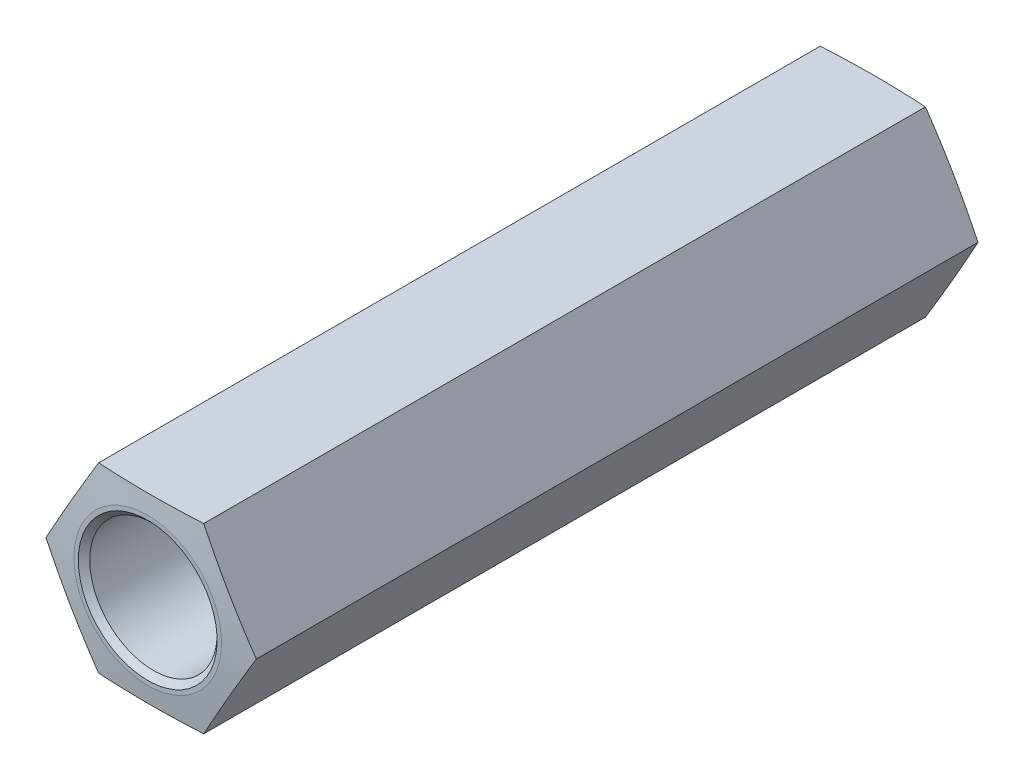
from build123d import *

# Parameters (mm, degrees)
SKETCH1_R      = 2.220000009
EXTRUDE1_DEPTH = 12.7
CHAMFER1_SIZE  = 0.2


with BuildPart() as part:
    # Sketch1 → Extrude1 (new, symmetric)
    with BuildSketch(Plane.XY):
        Polygon((-3.666174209, -6.3e-08), (-1.833087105, -3.175000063), (1.833087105, -3.174999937), (3.666174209, 6.3e-08), (1.833087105, 3.175000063), (-1.833087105, 3.174999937), align=None)
        with Locations((0, -6.3e-08)):
            Circle(SKETCH1_R, mode=Mode.SUBTRACT)
    extrude(amount=EXTRUDE1_DEPTH, both=True)

    # Chamfer1
    chamfer1_edges = [part.edges().sort_by_distance(p)[0] for p in [
        (-2.220000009, -6.3e-08, -12.7),
        (-2.220000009, -6.3e-08, 12.7),
    ]]
    chamfer(chamfer1_edges, length=CHAMFER1_SIZE)

    # Sketch2 → Cut-Revolve1 (revolve, cut)
    with BuildSketch(Plane.XZ, mode=Mode.PRIVATE) as cut_revolve1_sk:
        Polygon((-2.572739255, -12.7), (-3.666174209, -12.58), (-3.666174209, -12.7), align=None)
    cut_revolve1 = revolve(cut_revolve1_sk.sketch.rotate(Axis((0, -6.3e-08, 12.7), (0, 0, -1)), 359.999998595), axis=Axis((0, -6.3e-08, 12.7), (0, 0, -1)), mode=Mode.SUBTRACT)

    # Mirror1: Cut-Revolve1 across plane
    add(cut_revolve1.mirror(Plane.XY), mode=Mode.SUBTRACT)


solid = part.part
